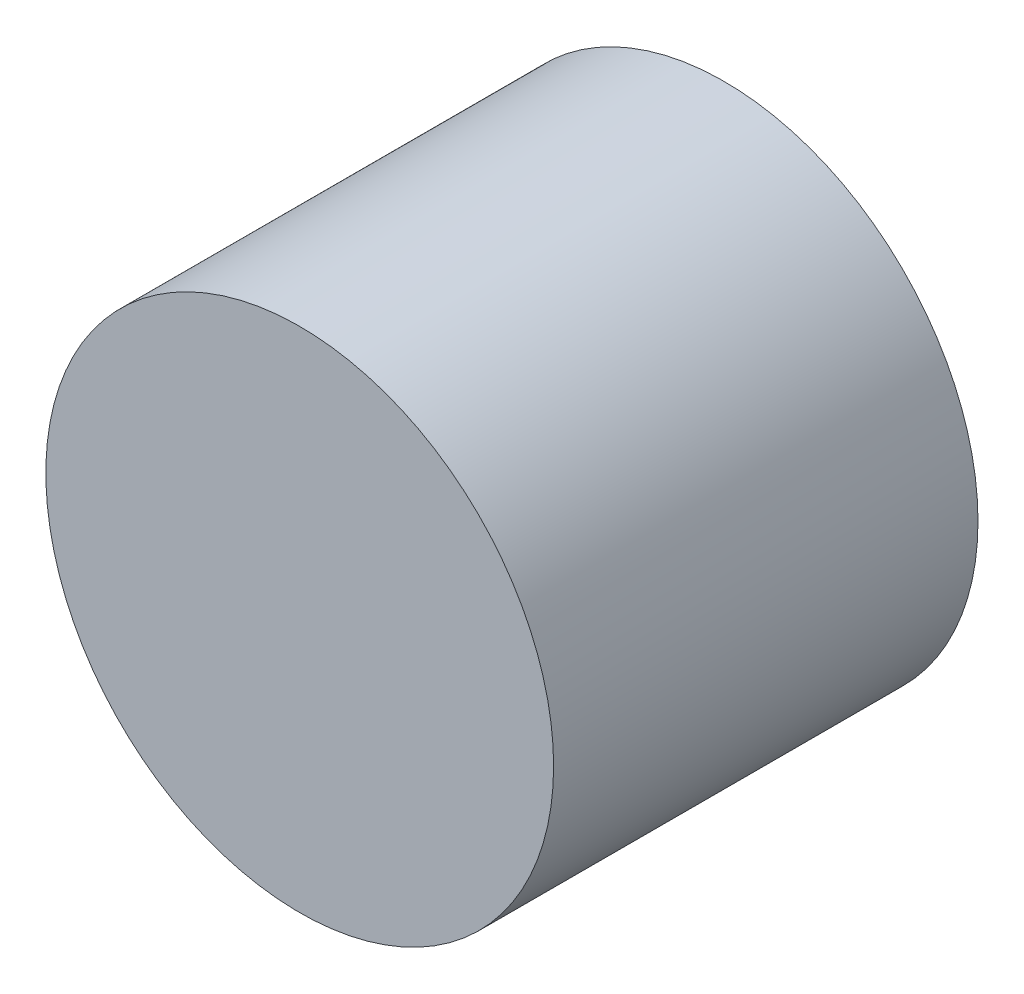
ISO-10303-21;
HEADER;
FILE_DESCRIPTION(('STEP AP214'),'2;1');
FILE_NAME('part.step','',(''),(''),'','','');
FILE_SCHEMA(('AUTOMOTIVE_DESIGN { 1 0 10303 214 1 1 1 1 }'));
ENDSEC;
DATA;
#1=APPLICATION_CONTEXT('core data for automotive mechanical design processes');
#2=APPLICATION_PROTOCOL_DEFINITION('international standard','automotive_design',2000,#1);
#3=PRODUCT_CONTEXT('',#1,'mechanical');
#4=PRODUCT('Part','Part','',(#3));
#5=PRODUCT_RELATED_PRODUCT_CATEGORY('part','',(#4));
#6=PRODUCT_DEFINITION_FORMATION('','',#4);
#7=PRODUCT_DEFINITION_CONTEXT('part definition',#1,'design');
#8=PRODUCT_DEFINITION('design','',#6,#7);
#9=PRODUCT_DEFINITION_SHAPE('','',#8);
#10=(LENGTH_UNIT() NAMED_UNIT(*) SI_UNIT(.MILLI.,.METRE.));
#11=(NAMED_UNIT(*) PLANE_ANGLE_UNIT() SI_UNIT($,.RADIAN.));
#12=(NAMED_UNIT(*) SI_UNIT($,.STERADIAN.) SOLID_ANGLE_UNIT());
#13=UNCERTAINTY_MEASURE_WITH_UNIT(LENGTH_MEASURE(1.E-05),#10,'distance_accuracy_value','');
#14=(GEOMETRIC_REPRESENTATION_CONTEXT(3) GLOBAL_UNCERTAINTY_ASSIGNED_CONTEXT((#13)) GLOBAL_UNIT_ASSIGNED_CONTEXT((#10,
#11,#12)) REPRESENTATION_CONTEXT('',''));
#15=CARTESIAN_POINT('',(0.,0.,0.));
#16=DIRECTION('',(0.,0.,1.));
#17=DIRECTION('',(1.,0.,0.));
#18=AXIS2_PLACEMENT_3D('',#15,#16,#17);
#19=CARTESIAN_POINT('',(132.,-1.65770021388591E-12,-15.));
#20=DIRECTION('',(0.,0.,1.));
#21=DIRECTION('',(1.,0.,0.));
#22=AXIS2_PLACEMENT_3D('',#19,#20,#21);
#23=CYLINDRICAL_SURFACE('',#22,7.77741495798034);
#24=CARTESIAN_POINT('',(132.,-1.65770021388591E-12,-15.));
#25=DIRECTION('',(0.,0.,1.));
#26=DIRECTION('',(1.,0.,0.));
#27=AXIS2_PLACEMENT_3D('',#24,#25,#26);
#28=CIRCLE('',#27,7.77741495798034);
#29=CARTESIAN_POINT('',(139.777414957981,-1.65770021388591E-12,-15.));
#30=VERTEX_POINT('',#29);
#31=EDGE_CURVE('E10',#30,#30,#28,.T.);
#32=ORIENTED_EDGE('',*,*,#31,.T.);
#33=EDGE_LOOP('',(#32));
#34=FACE_BOUND('',#33,.T.);
#35=CARTESIAN_POINT('',(132.,-1.65770021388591E-12,-2.));
#36=DIRECTION('',(0.,0.,1.));
#37=DIRECTION('',(1.,0.,0.));
#38=AXIS2_PLACEMENT_3D('',#35,#36,#37);
#39=CIRCLE('',#38,7.77741495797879);
#40=CARTESIAN_POINT('',(139.777414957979,-1.65770021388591E-12,-2.));
#41=VERTEX_POINT('',#40);
#42=EDGE_CURVE('E36',#41,#41,#39,.T.);
#43=ORIENTED_EDGE('',*,*,#42,.F.);
#44=EDGE_LOOP('',(#43));
#45=FACE_BOUND('',#44,.T.);
#46=ADVANCED_FACE('F30',(#34,#45),#23,.T.);
#47=CARTESIAN_POINT('',(132.,-1.65770021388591E-12,-15.));
#48=DIRECTION('',(0.,0.,1.));
#49=DIRECTION('',(1.,0.,0.));
#50=AXIS2_PLACEMENT_3D('',#47,#48,#49);
#51=PLANE('',#50);
#52=ORIENTED_EDGE('',*,*,#31,.F.);
#53=EDGE_LOOP('',(#52));
#54=FACE_BOUND('',#53,.T.);
#55=ADVANCED_FACE('F45',(#54),#51,.F.);
#56=CARTESIAN_POINT('',(132.,-1.65770021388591E-12,-2.));
#57=DIRECTION('',(0.,0.,1.));
#58=DIRECTION('',(1.,0.,0.));
#59=AXIS2_PLACEMENT_3D('',#56,#57,#58);
#60=PLANE('',#59);
#61=ORIENTED_EDGE('',*,*,#42,.T.);
#62=EDGE_LOOP('',(#61));
#63=FACE_BOUND('',#62,.T.);
#64=ADVANCED_FACE('F42',(#63),#60,.T.);
#65=CLOSED_SHELL('',(#46,#55,#64));
#66=MANIFOLD_SOLID_BREP('B2',#65);
#67=ADVANCED_BREP_SHAPE_REPRESENTATION('',(#18,#66),#14);
#68=SHAPE_DEFINITION_REPRESENTATION(#9,#67);
ENDSEC;
END-ISO-10303-21;
